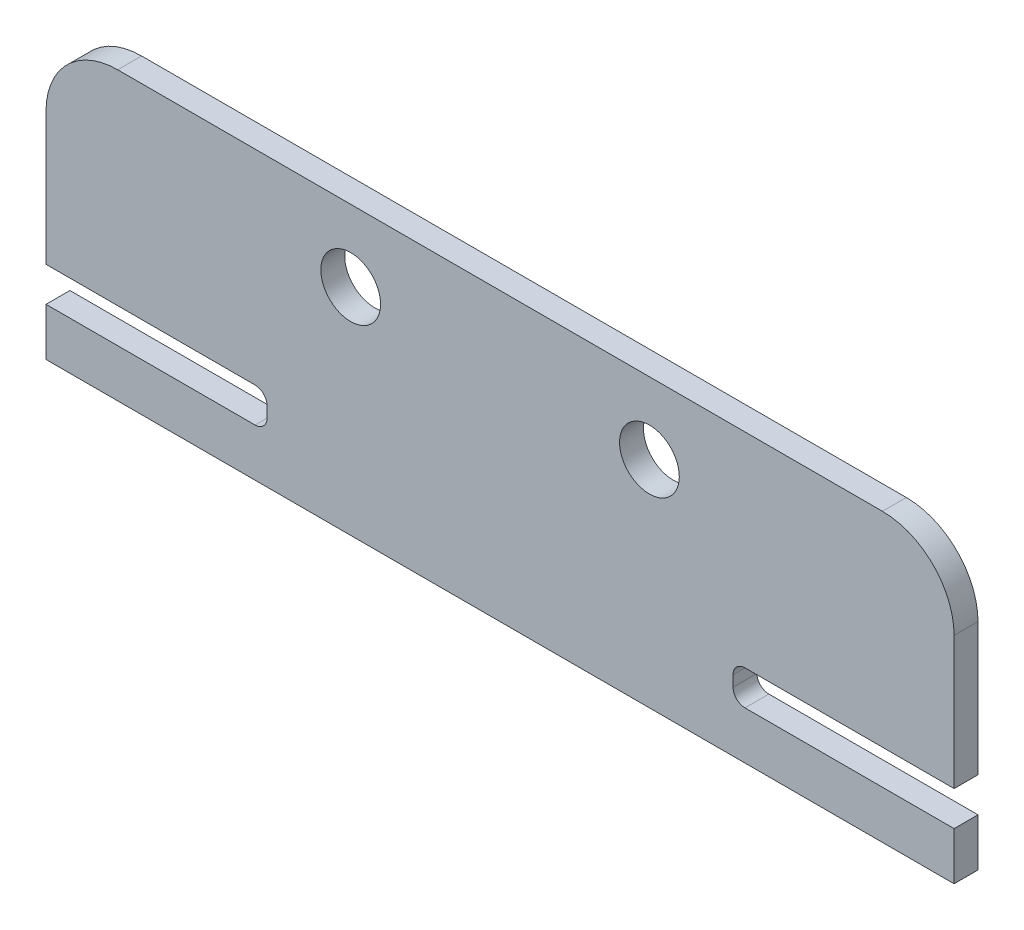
from build123d import *

# Parameters (mm, degrees)
SKETCH1_R      = 31.75
EXTRUDE1_DEPTH = 25.4
FILLET1_R      = 76.2
FILLET2_R      = 12.7


with BuildPart() as part:
    # Sketch1 → Extrude1 (new body)
    with BuildSketch(Plane.XY):
        Polygon((-279.4, 76.2), (279.4, 76.2), (482.6, 76.2), (482.6, -140.97), (247.65, -140.97), (247.65, -177.8), (482.6, -177.8), (482.6, -228.6), (-482.6, -228.6), (-482.6, -177.8), (-247.65, -177.8), (-247.65, -140.97), (-482.6, -140.97), (-482.6, 76.2), align=None)
        with Locations((158.75, 0)):
            Circle(SKETCH1_R, mode=Mode.SUBTRACT)
        with Locations((-158.75, 0)):
            Circle(SKETCH1_R, mode=Mode.SUBTRACT)
    extrude(amount=EXTRUDE1_DEPTH)

    # Fillet1
    fillet1_edges = [part.edges().sort_by_distance(p)[0] for p in [
        (-482.6, 76.2, 12.7),
        (482.6, 76.2, 12.7),
    ]]
    fillet(fillet1_edges, radius=FILLET1_R)

    # Fillet2
    fillet2_edges = [part.edges().sort_by_distance(p)[0] for p in [
        (247.65, -140.97, 12.7),
        (247.65, -177.8, 12.7),
        (-247.65, -140.97, 12.7),
        (-247.65, -177.8, 12.7),
    ]]
    fillet(fillet2_edges, radius=FILLET2_R)


solid = part.part
